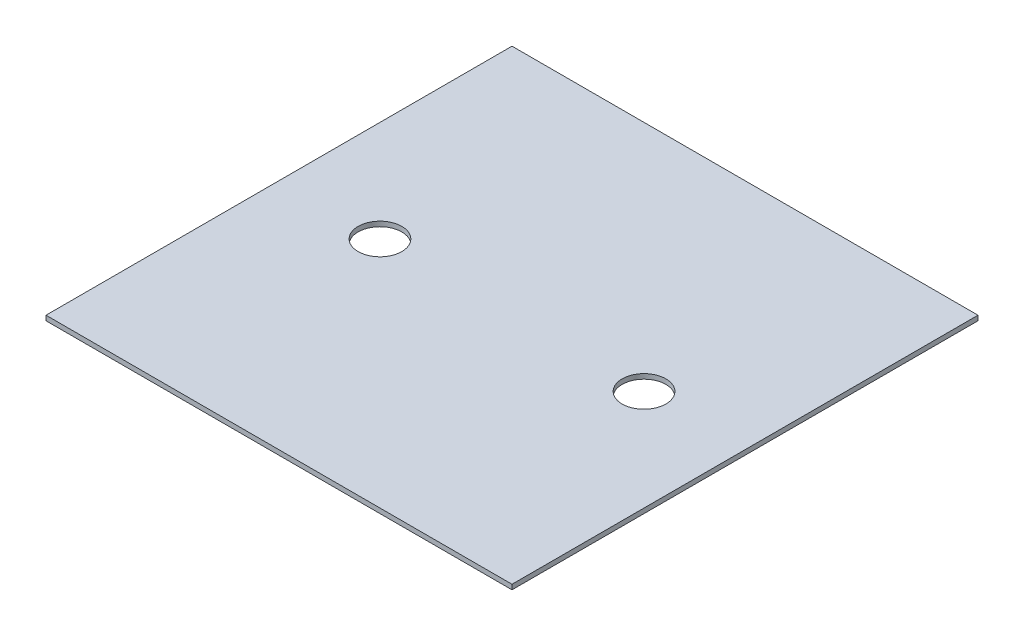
from build123d import *

# Parameters (mm, degrees)
SKETCH1_W           = 152.4
SKETCH1_H           = 152.4
BOSS_EXTRUDE1_DEPTH = 1.5875
SKETCH2_R           = 7.14375
CUT_EXTRUDE1_DEPTH  = 25.4


with BuildPart() as part:
    # Sketch1 → Boss-Extrude1 (new body)
    with BuildSketch(Plane(origin=(0, 0, 0), x_dir=(1, 0, 0), z_dir=(0, 1, 0))):
        Rectangle(SKETCH1_W, SKETCH1_H)
    extrude(amount=BOSS_EXTRUDE1_DEPTH)

    # Sketch2 → Cut-Extrude1 (cut)
    with BuildSketch(Plane(origin=(0, 0, 0), x_dir=(1, 0, 0), z_dir=(0, 1, 0))):
        with Locations(Location((-43.18, 0, 0), (0, 0, 270))):
            Circle(SKETCH2_R)
        with Locations(Location((43.18, 0, 0), (0, 0, 270))):
            Circle(SKETCH2_R)
    extrude(amount=CUT_EXTRUDE1_DEPTH, mode=Mode.SUBTRACT)


solid = part.part
